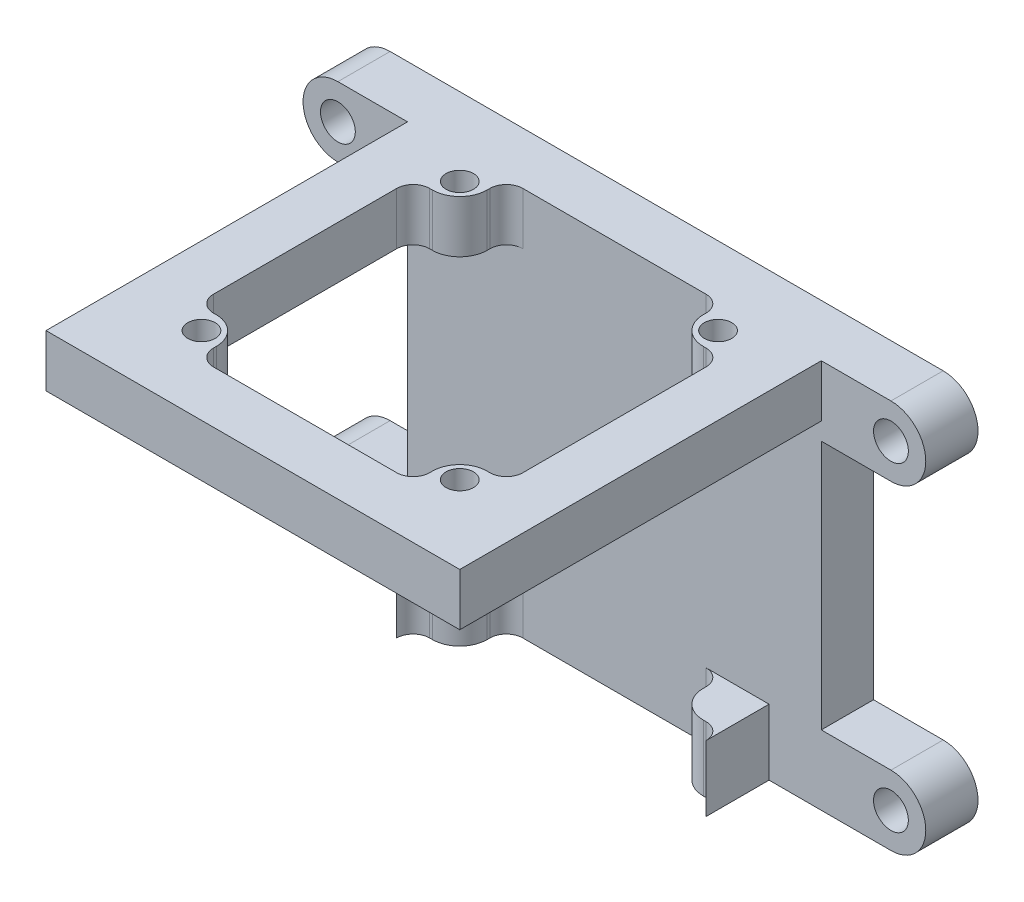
from build123d import *

# Parameters (mm, degrees)
SKETCH1_W           = 75.449949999
SKETCH1_H           = 75.449949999
SKETCH1_R           = 2.5
BOSS_EXTRUDE2_DEPTH = 9.525
SKETCH2_W           = 75.449949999
SKETCH2_H           = 9.524999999
BOSS_EXTRUDE3_DEPTH = 61.475
BOSS_EXTRUDE4_START = -12
BOSS_EXTRUDE4_DEPTH = 12
SKETCH7_R           = 3.175
BOSS_EXTRUDE8_DEPTH = 9.524999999


with BuildPart() as part:
    # Sketch1 → Boss-Extrude2 (new body)
    with BuildSketch(Plane.XZ.offset(-901.929361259)):
        with Locations((462.575718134, 1286.488009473)):
            Rectangle(SKETCH1_W, SKETCH1_H)
        with Locations(Location((439.025693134, 1262.938034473, 0), (0, 0, 90))):
            Circle(SKETCH1_R, mode=Mode.SUBTRACT)
        with Locations(Location((439.025693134, 1310.038034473, 0), (0, 0, 90))):
            Circle(SKETCH1_R, mode=Mode.SUBTRACT)
        with Locations(Location((486.125693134, 1262.938034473, 0), (0, 0, 90))):
            Circle(SKETCH1_R, mode=Mode.SUBTRACT)
        with Locations(Location((486.125693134, 1310.038034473, 0), (0, 0, 90))):
            Circle(SKETCH1_R, mode=Mode.SUBTRACT)
        with BuildLine():
            Line((482.275693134, 1261.788034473), (482.275693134, 1261.288034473))
            ThreePointArc((482.275693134, 1261.288034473), (481.397013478, 1259.166714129), (479.275693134, 1258.288034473))
            Line((479.275693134, 1258.288034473), (445.875693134, 1258.288034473))
            ThreePointArc((445.875693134, 1258.288034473), (443.754372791, 1259.166714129), (442.875693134, 1261.288034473))
            Line((442.875693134, 1261.288034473), (442.875693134, 1261.788034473))
            ThreePointArc((442.875693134, 1261.788034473), (441.41122704, 1265.323568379), (437.875693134, 1266.788034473))
            Line((437.875693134, 1266.788034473), (437.375693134, 1266.788034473))
            ThreePointArc((437.375693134, 1266.788034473), (435.254372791, 1267.666714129), (434.375693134, 1269.788034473))
            Line((434.375693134, 1269.788034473), (434.375793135, 1303.187984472))
            ThreePointArc((434.375793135, 1303.187984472), (435.254472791, 1305.309254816), (437.375743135, 1306.187934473))
            Line((437.375743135, 1306.187934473), (437.875743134, 1306.187934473))
            ThreePointArc((437.875743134, 1306.187934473), (441.41132704, 1307.652400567), (442.875793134, 1311.187984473))
            Line((442.875793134, 1311.187984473), (442.875793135, 1311.687984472))
            ThreePointArc((442.875793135, 1311.687984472), (443.754472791, 1313.809254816), (445.875743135, 1314.687934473))
            Line((445.875743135, 1314.687934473), (479.275693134, 1314.688034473))
            ThreePointArc((479.275693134, 1314.688034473), (481.397013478, 1313.809354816), (482.275693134, 1311.688034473))
            Line((482.275693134, 1311.688034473), (482.275693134, 1311.188034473))
            ThreePointArc((482.275693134, 1311.188034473), (483.740159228, 1307.652500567), (487.275693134, 1306.188034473))
            Line((487.275693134, 1306.188034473), (487.775693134, 1306.188034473))
            ThreePointArc((487.775693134, 1306.188034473), (489.897013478, 1305.309354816), (490.775693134, 1303.188034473))
            Line((490.775693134, 1303.188034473), (490.775693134, 1269.788034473))
            ThreePointArc((490.775693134, 1269.788034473), (489.897013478, 1267.666714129), (487.775693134, 1266.788034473))
            Line((487.775693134, 1266.788034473), (487.275693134, 1266.788034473))
            ThreePointArc((487.275693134, 1266.788034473), (483.740159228, 1265.323568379), (482.275693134, 1261.788034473))
        make_face(mode=Mode.SUBTRACT)
    extrude(amount=BOSS_EXTRUDE2_DEPTH)

    # Sketch2 → Boss-Extrude3 (add)
    with BuildSketch(Plane.XZ.offset(-892.404361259)):
        with Locations((462.575718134, 1253.525534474)):
            Rectangle(SKETCH2_W, SKETCH2_H)
    extrude(amount=BOSS_EXTRUDE3_DEPTH)

    # Sketch3 → Boss-Extrude4 (add)
    with BuildSketch(Plane.XZ.offset(-830.929361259).offset(BOSS_EXTRUDE4_START)):
        with BuildLine():
            Line((487.275693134, 1266.788034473), (487.775693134, 1266.788034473))
            ThreePointArc((487.775693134, 1266.788034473), (489.897013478, 1267.666714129), (490.775693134, 1269.788034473))
            Line((490.775693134, 1269.788034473), (490.775693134, 1258.288034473))
            Line((490.775693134, 1258.288034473), (479.275693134, 1258.288034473))
            ThreePointArc((479.275693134, 1258.288034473), (481.397013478, 1259.166714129), (482.275693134, 1261.288034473))
            Line((482.275693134, 1261.288034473), (482.275693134, 1261.788034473))
            ThreePointArc((482.275693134, 1261.788034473), (483.740159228, 1265.323568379), (487.275693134, 1266.788034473))
        make_face()
        with BuildLine():
            Line((437.375693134, 1266.788034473), (437.875693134, 1266.788034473))
            ThreePointArc((437.875693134, 1266.788034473), (441.41122704, 1265.323568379), (442.875693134, 1261.788034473))
            Line((442.875693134, 1261.788034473), (442.875693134, 1261.288034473))
            ThreePointArc((442.875693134, 1261.288034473), (443.754372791, 1259.166714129), (445.875693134, 1258.288034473))
            Line((445.875693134, 1258.288034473), (434.375693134, 1258.288034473))
            Line((434.375693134, 1258.288034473), (434.375693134, 1269.788034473))
            ThreePointArc((434.375693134, 1269.788034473), (435.254372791, 1267.666714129), (437.375693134, 1266.788034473))
        make_face()
    extrude(amount=BOSS_EXTRUDE4_DEPTH)

    # Sketch7 → Boss-Extrude8 (add)
    # profile 1 of 4: a face of its own
    with BuildSketch(Plane(origin=(0, 0, 1248.763034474), x_dir=(-1, 0, 0), z_dir=(0, 0, -1))):
        with BuildLine():
            Line((-500.300693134, 901.929361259), (-513.000693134, 901.929361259))
            ThreePointArc((-513.000693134, 901.929361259), (-519.350693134, 895.579361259), (-513.000693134, 889.229361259))
            Line((-513.000693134, 889.229361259), (-500.300693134, 889.229361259))
            Line((-500.300693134, 889.229361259), (-500.300693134, 901.929361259))
        make_face()
        with Locations((-513.000693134, 895.579361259)):
            Circle(SKETCH7_R, mode=Mode.SUBTRACT)
    # profile 2 of 4: a face of its own
    with BuildSketch(Plane(origin=(0, 0, 1248.763034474), x_dir=(-1, 0, 0), z_dir=(0, 0, -1))):
        with BuildLine():
            Line((-424.850743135, 889.229361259), (-424.850743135, 901.929361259))
            Line((-424.850743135, 901.929361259), (-412.150743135, 901.929361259))
            ThreePointArc((-412.150743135, 901.929361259), (-405.800743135, 895.579361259), (-412.150743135, 889.229361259))
            Line((-412.150743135, 889.229361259), (-424.850743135, 889.229361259))
        make_face()
        with Locations((-412.150743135, 895.579361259)):
            Circle(SKETCH7_R, mode=Mode.SUBTRACT)
    # profile 3 of 4: a face of its own
    with BuildSketch(Plane(origin=(0, 0, 1248.763034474), x_dir=(-1, 0, 0), z_dir=(0, 0, -1))):
        with BuildLine():
            Line((-424.850743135, 830.929361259), (-412.150743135, 830.929361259))
            ThreePointArc((-412.150743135, 830.929361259), (-405.800743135, 837.279361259), (-412.150743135, 843.629361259))
            Line((-412.150743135, 843.629361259), (-424.850743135, 843.629361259))
            Line((-424.850743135, 843.629361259), (-424.850743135, 830.929361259))
        make_face()
        with Locations((-412.150743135, 837.279361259)):
            Circle(SKETCH7_R, mode=Mode.SUBTRACT)
    # profile 4 of 4: a face of its own
    with BuildSketch(Plane(origin=(0, 0, 1248.763034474), x_dir=(-1, 0, 0), z_dir=(0, 0, -1))):
        with BuildLine():
            Line((-500.300693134, 843.629361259), (-500.300693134, 830.929361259))
            Line((-500.300693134, 830.929361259), (-513.000693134, 830.929361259))
            ThreePointArc((-513.000693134, 830.929361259), (-519.350693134, 837.279361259), (-513.000693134, 843.629361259))
            Line((-513.000693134, 843.629361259), (-500.300693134, 843.629361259))
        make_face()
        with Locations((-513.000693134, 837.279361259)):
            Circle(SKETCH7_R, mode=Mode.SUBTRACT)
    extrude(amount=-BOSS_EXTRUDE8_DEPTH)


solid = part.part
